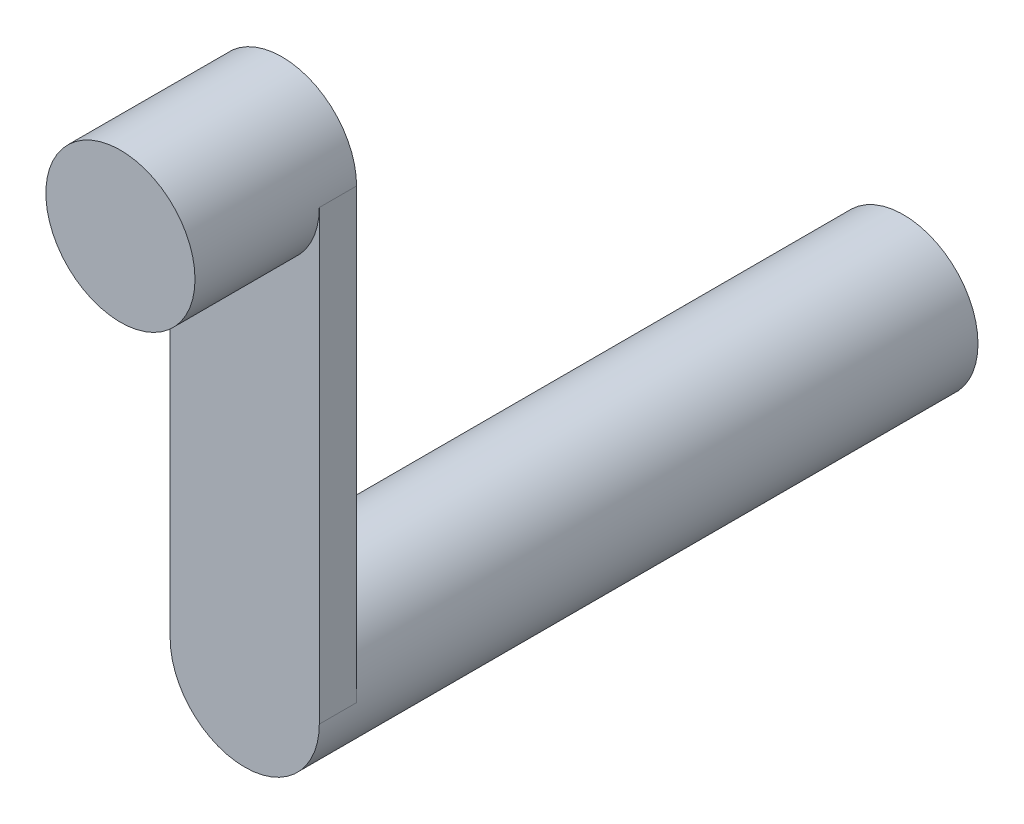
from build123d import *

# Parameters (mm, degrees)
ESQUISSE1_R      = 6
EXTRUSION1_DEPTH = 50
EXTRUSION2_DEPTH = 3
ESQUISSE3_R      = 6
EXTRUSION3_DEPTH = 10


with BuildPart() as part:
    # Esquisse1 → Extrusion1 (new body)
    with BuildSketch(Plane.XY):
        Circle(ESQUISSE1_R)
    extrude(amount=EXTRUSION1_DEPTH)

    # Esquisse2 → Extrusion2 (add)
    with BuildSketch(Plane.XY.offset(50)):
        with BuildLine():
            Line((-6, 36), (-6, 0))
            ThreePointArc((-6, 0), (0, -6), (6, 0))
            Line((6, 0), (6, 36))
            ThreePointArc((6, 36), (0, 42), (-6, 36))
        make_face()
    extrude(amount=EXTRUSION2_DEPTH)

    # Esquisse3 → Extrusion3 (add)
    with BuildSketch(Plane.XY.offset(53)):
        with Locations((0, 36)):
            Circle(ESQUISSE3_R)
    extrude(amount=EXTRUSION3_DEPTH)


solid = part.part
